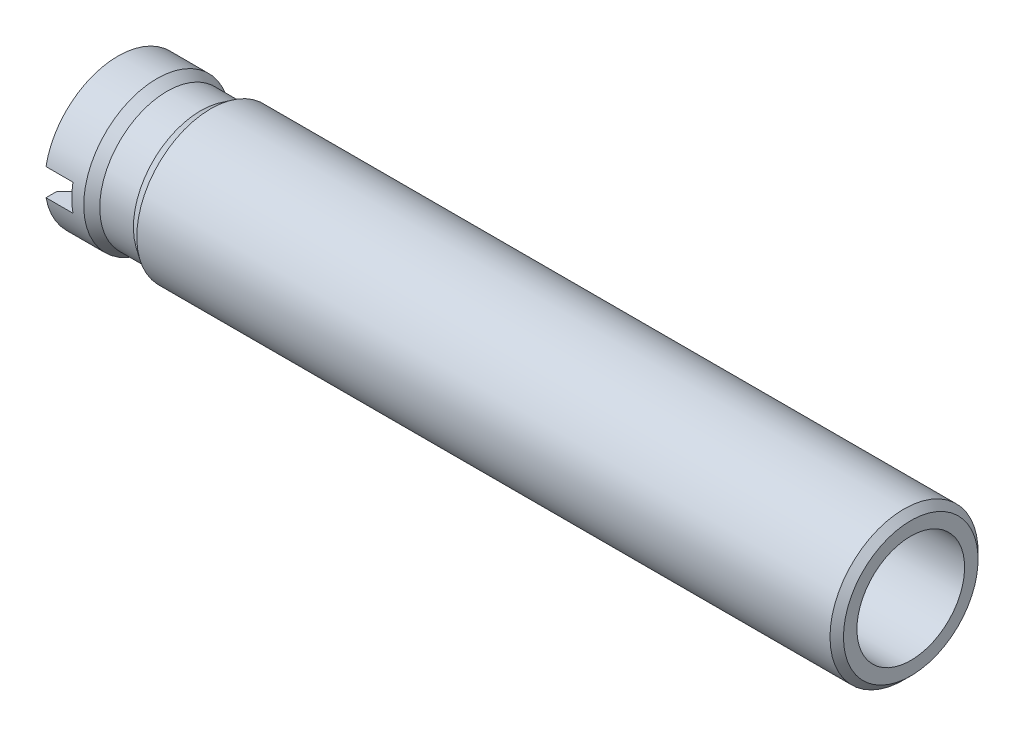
ISO-10303-21;
HEADER;
FILE_DESCRIPTION(('STEP AP214'),'2;1');
FILE_NAME('part.step','',(''),(''),'','','');
FILE_SCHEMA(('AUTOMOTIVE_DESIGN { 1 0 10303 214 1 1 1 1 }'));
ENDSEC;
DATA;
#1=APPLICATION_CONTEXT('core data for automotive mechanical design processes');
#2=APPLICATION_PROTOCOL_DEFINITION('international standard','automotive_design',2000,#1);
#3=PRODUCT_CONTEXT('',#1,'mechanical');
#4=PRODUCT('Part','Part','',(#3));
#5=PRODUCT_RELATED_PRODUCT_CATEGORY('part','',(#4));
#6=PRODUCT_DEFINITION_FORMATION('','',#4);
#7=PRODUCT_DEFINITION_CONTEXT('part definition',#1,'design');
#8=PRODUCT_DEFINITION('design','',#6,#7);
#9=PRODUCT_DEFINITION_SHAPE('','',#8);
#10=(LENGTH_UNIT() NAMED_UNIT(*) SI_UNIT(.MILLI.,.METRE.));
#11=(NAMED_UNIT(*) PLANE_ANGLE_UNIT() SI_UNIT($,.RADIAN.));
#12=(NAMED_UNIT(*) SI_UNIT($,.STERADIAN.) SOLID_ANGLE_UNIT());
#13=UNCERTAINTY_MEASURE_WITH_UNIT(LENGTH_MEASURE(1.E-05),#10,'distance_accuracy_value','');
#14=(GEOMETRIC_REPRESENTATION_CONTEXT(3) GLOBAL_UNCERTAINTY_ASSIGNED_CONTEXT((#13)) GLOBAL_UNIT_ASSIGNED_CONTEXT((#10,
#11,#12)) REPRESENTATION_CONTEXT('',''));
#15=CARTESIAN_POINT('',(0.,0.,0.));
#16=DIRECTION('',(0.,0.,1.));
#17=DIRECTION('',(1.,0.,0.));
#18=AXIS2_PLACEMENT_3D('',#15,#16,#17);
#19=CARTESIAN_POINT('',(-76.4736831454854,1.00000010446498,0.));
#20=DIRECTION('',(-1.,0.,0.));
#21=DIRECTION('',(0.,0.,1.));
#22=AXIS2_PLACEMENT_3D('',#19,#20,#21);
#23=CONICAL_SURFACE('',#22,7.00000000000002,0.531972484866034);
#24=CARTESIAN_POINT('',(-77.9736831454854,1.00000010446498,0.));
#25=DIRECTION('',(-1.,0.,0.));
#26=DIRECTION('',(0.,1.,0.));
#27=AXIS2_PLACEMENT_3D('',#24,#25,#26);
#28=CIRCLE('',#27,7.88285457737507);
#29=CARTESIAN_POINT('',(-77.9736831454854,8.88285468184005,0.));
#30=VERTEX_POINT('',#29);
#31=EDGE_CURVE('E173',#30,#30,#28,.F.);
#32=ORIENTED_EDGE('',*,*,#31,.F.);
#33=EDGE_LOOP('',(#32));
#34=FACE_BOUND('',#33,.T.);
#35=CARTESIAN_POINT('',(-76.4736831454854,1.00000010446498,0.));
#36=DIRECTION('',(-1.,0.,0.));
#37=DIRECTION('',(0.,1.,0.));
#38=AXIS2_PLACEMENT_3D('',#35,#36,#37);
#39=CIRCLE('',#38,7.00000000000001);
#40=CARTESIAN_POINT('',(-76.4736831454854,8.00000010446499,0.));
#41=VERTEX_POINT('',#40);
#42=EDGE_CURVE('E170',#41,#41,#39,.T.);
#43=ORIENTED_EDGE('',*,*,#42,.F.);
#44=EDGE_LOOP('',(#43));
#45=FACE_BOUND('',#44,.T.);
#46=ADVANCED_FACE('F17',(#34,#45),#23,.F.);
#47=CARTESIAN_POINT('',(-85.0514735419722,3.00000010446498,0.));
#48=DIRECTION('',(0.,1.,0.));
#49=DIRECTION('',(0.,0.,1.));
#50=AXIS2_PLACEMENT_3D('',#47,#48,#49);
#51=PLANE('',#50);
#52=DIRECTION('',(0.,0.,1.));
#53=VECTOR('',#52,1.);
#54=CARTESIAN_POINT('',(-83.7631567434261,3.00000010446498,0.));
#55=LINE('',#54,#53);
#56=CARTESIAN_POINT('',(-83.7631567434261,3.00000010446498,9.16722204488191));
#57=VERTEX_POINT('',#56);
#58=CARTESIAN_POINT('',(-83.7631567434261,3.00000010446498,10.6969827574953));
#59=VERTEX_POINT('',#58);
#60=EDGE_CURVE('E103',#57,#59,#55,.T.);
#61=ORIENTED_EDGE('',*,*,#60,.F.);
#62=CARTESIAN_POINT('',(-82.2631567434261,3.00000010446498,7.62491942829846));
#63=CARTESIAN_POINT('',(-82.3878068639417,3.00000010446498,7.75378454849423));
#64=CARTESIAN_POINT('',(-82.5125603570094,3.00000010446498,7.88254960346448));
#65=CARTESIAN_POINT('',(-82.7622493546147,3.00000010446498,8.13990274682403));
#66=CARTESIAN_POINT('',(-82.8871848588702,3.00000010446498,8.26849083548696));
#67=CARTESIAN_POINT('',(-83.1372134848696,3.00000010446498,8.52551356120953));
#68=CARTESIAN_POINT('',(-83.2623066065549,3.00000010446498,8.65394819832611));
#69=CARTESIAN_POINT('',(-83.5126320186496,3.00000010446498,8.91068217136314));
#70=CARTESIAN_POINT('',(-83.6378643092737,3.00000010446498,9.03898150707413));
#71=CARTESIAN_POINT('',(-83.7631567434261,3.00000010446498,9.16722204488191));
#72=B_SPLINE_CURVE_WITH_KNOTS('',3,(#62,#63,#64,#65,#66,#67,#68,#69,#70,#71),.UNSPECIFIED.,.F.,
.F.,(4,2,2,2,4),(0.,0.53786122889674,1.07572162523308,1.61358182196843,2.15144285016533),.UNSPECIFIED.);
#73=CARTESIAN_POINT('',(-82.2631567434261,3.00000010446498,7.62491942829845));
#74=VERTEX_POINT('',#73);
#75=EDGE_CURVE('E109',#74,#57,#72,.T.);
#76=ORIENTED_EDGE('',*,*,#75,.F.);
#77=DIRECTION('',(1.,0.,0.));
#78=VECTOR('',#77,1.);
#79=CARTESIAN_POINT('',(-85.0514735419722,3.00000010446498,7.62491942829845));
#80=LINE('',#79,#78);
#81=CARTESIAN_POINT('',(-79.7631567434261,3.00000010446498,7.62491942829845));
#82=VERTEX_POINT('',#81);
#83=EDGE_CURVE('E97',#82,#74,#80,.F.);
#84=ORIENTED_EDGE('',*,*,#83,.F.);
#85=DIRECTION('',(0.,0.,-1.));
#86=VECTOR('',#85,1.);
#87=CARTESIAN_POINT('',(-79.7631567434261,3.00000010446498,0.));
#88=LINE('',#87,#86);
#89=CARTESIAN_POINT('',(-79.7631567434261,3.00000010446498,10.6969827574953));
#90=VERTEX_POINT('',#89);
#91=EDGE_CURVE('E102',#82,#90,#88,.F.);
#92=ORIENTED_EDGE('',*,*,#91,.T.);
#93=DIRECTION('',(1.,0.,0.));
#94=VECTOR('',#93,1.);
#95=CARTESIAN_POINT('',(-80.8679873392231,3.00000010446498,10.6969827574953));
#96=LINE('',#95,#94);
#97=EDGE_CURVE('E168',#59,#90,#96,.T.);
#98=ORIENTED_EDGE('',*,*,#97,.F.);
#99=EDGE_LOOP('',(#61,#76,#84,#92,#98));
#100=FACE_BOUND('',#99,.T.);
#101=ADVANCED_FACE('F105',(#100),#51,.F.);
#102=CARTESIAN_POINT('',(-79.7631567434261,3.00000010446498,0.));
#103=DIRECTION('',(1.,0.,0.));
#104=DIRECTION('',(0.,0.,-1.));
#105=AXIS2_PLACEMENT_3D('',#102,#103,#104);
#106=PLANE('',#105);
#107=ORIENTED_EDGE('',*,*,#91,.F.);
#108=CARTESIAN_POINT('',(-79.7631567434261,1.00000010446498,0.));
#109=DIRECTION('',(1.,0.,0.));
#110=DIRECTION('',(0.,0.,-1.));
#111=AXIS2_PLACEMENT_3D('',#108,#109,#110);
#112=CIRCLE('',#111,7.88285457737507);
#113=CARTESIAN_POINT('',(-79.7631567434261,-0.999999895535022,7.62491942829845));
#114=VERTEX_POINT('',#113);
#115=EDGE_CURVE('E21',#114,#82,#112,.F.);
#116=ORIENTED_EDGE('',*,*,#115,.F.);
#117=DIRECTION('',(0.,0.,-1.));
#118=VECTOR('',#117,1.);
#119=CARTESIAN_POINT('',(-79.7631567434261,-0.999999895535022,0.));
#120=LINE('',#119,#118);
#121=CARTESIAN_POINT('',(-79.7631567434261,-0.999999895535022,10.6969827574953));
#122=VERTEX_POINT('',#121);
#123=EDGE_CURVE('E121',#114,#122,#120,.F.);
#124=ORIENTED_EDGE('',*,*,#123,.T.);
#125=CARTESIAN_POINT('',(-79.7631567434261,1.00000010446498,0.));
#126=DIRECTION('',(1.,0.,0.));
#127=DIRECTION('',(0.,1.,0.));
#128=AXIS2_PLACEMENT_3D('',#125,#126,#127);
#129=CIRCLE('',#128,10.8823453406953);
#130=EDGE_CURVE('E114',#90,#122,#129,.T.);
#131=ORIENTED_EDGE('',*,*,#130,.F.);
#132=EDGE_LOOP('',(#107,#116,#124,#131));
#133=FACE_BOUND('',#132,.T.);
#134=ADVANCED_FACE('F112',(#133),#106,.F.);
#135=CARTESIAN_POINT('',(-79.7631567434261,-0.999999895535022,0.));
#136=DIRECTION('',(0.,-1.,0.));
#137=DIRECTION('',(0.,0.,-1.));
#138=AXIS2_PLACEMENT_3D('',#135,#136,#137);
#139=PLANE('',#138);
#140=ORIENTED_EDGE('',*,*,#123,.F.);
#141=DIRECTION('',(1.,0.,0.));
#142=VECTOR('',#141,1.);
#143=CARTESIAN_POINT('',(-79.7631567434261,-0.999999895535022,7.62491942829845));
#144=LINE('',#143,#142);
#145=CARTESIAN_POINT('',(-82.2631567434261,-0.999999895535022,7.62491942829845));
#146=VERTEX_POINT('',#145);
#147=EDGE_CURVE('E92',#146,#114,#144,.T.);
#148=ORIENTED_EDGE('',*,*,#147,.F.);
#149=CARTESIAN_POINT('',(-83.7631567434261,-0.999999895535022,9.16722204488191));
#150=CARTESIAN_POINT('',(-83.6378643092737,-0.999999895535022,9.03898150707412));
#151=CARTESIAN_POINT('',(-83.5126320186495,-0.999999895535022,8.91068217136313));
#152=CARTESIAN_POINT('',(-83.2623066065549,-0.999999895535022,8.6539481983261));
#153=CARTESIAN_POINT('',(-83.1372134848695,-0.999999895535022,8.52551356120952));
#154=CARTESIAN_POINT('',(-82.8871848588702,-0.999999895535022,8.26849083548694));
#155=CARTESIAN_POINT('',(-82.7622493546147,-0.999999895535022,8.13990274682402));
#156=CARTESIAN_POINT('',(-82.5125603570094,-0.999999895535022,7.88254960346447));
#157=CARTESIAN_POINT('',(-82.3878068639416,-0.999999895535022,7.75378454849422));
#158=CARTESIAN_POINT('',(-82.2631567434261,-0.999999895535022,7.62491942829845));
#159=B_SPLINE_CURVE_WITH_KNOTS('',3,(#149,#150,#151,#152,#153,#154,#155,#156,#157,#158),
.UNSPECIFIED.,.F.,.F.,(4,2,2,2,4),(0.,0.537861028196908,1.07572122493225,1.61358162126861,
2.15144285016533),.UNSPECIFIED.);
#160=CARTESIAN_POINT('',(-83.7631567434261,-0.999999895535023,9.16722204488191));
#161=VERTEX_POINT('',#160);
#162=EDGE_CURVE('E174',#161,#146,#159,.T.);
#163=ORIENTED_EDGE('',*,*,#162,.F.);
#164=DIRECTION('',(0.,0.,-1.));
#165=VECTOR('',#164,1.);
#166=CARTESIAN_POINT('',(-83.7631567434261,-0.999999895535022,0.));
#167=LINE('',#166,#165);
#168=CARTESIAN_POINT('',(-83.7631567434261,-0.999999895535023,10.6969827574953));
#169=VERTEX_POINT('',#168);
#170=EDGE_CURVE('E116',#169,#161,#167,.T.);
#171=ORIENTED_EDGE('',*,*,#170,.F.);
#172=DIRECTION('',(1.,0.,0.));
#173=VECTOR('',#172,1.);
#174=CARTESIAN_POINT('',(-80.8679873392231,-0.999999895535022,10.6969827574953));
#175=LINE('',#174,#173);
#176=EDGE_CURVE('E177',#122,#169,#175,.F.);
#177=ORIENTED_EDGE('',*,*,#176,.F.);
#178=EDGE_LOOP('',(#140,#148,#163,#171,#177));
#179=FACE_BOUND('',#178,.T.);
#180=ADVANCED_FACE('F238',(#179),#139,.F.);
#181=CARTESIAN_POINT('',(-82.2631567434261,1.00000010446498,0.));
#182=DIRECTION('',(-1.,0.,0.));
#183=DIRECTION('',(0.,0.,1.));
#184=AXIS2_PLACEMENT_3D('',#181,#182,#183);
#185=CONICAL_SURFACE('',#184,7.88285457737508,0.785398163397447);
#186=CARTESIAN_POINT('',(-82.2631567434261,-0.999999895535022,-7.62491942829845));
#187=CARTESIAN_POINT('',(-82.3878068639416,-0.999999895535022,-7.75378454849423));
#188=CARTESIAN_POINT('',(-82.5125603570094,-0.999999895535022,-7.88254960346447));
#189=CARTESIAN_POINT('',(-82.7622493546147,-0.999999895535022,-8.13990274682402));
#190=CARTESIAN_POINT('',(-82.8871848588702,-0.999999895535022,-8.26849083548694));
#191=CARTESIAN_POINT('',(-83.1372134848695,-0.999999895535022,-8.52551356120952));
#192=CARTESIAN_POINT('',(-83.2623066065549,-0.999999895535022,-8.6539481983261));
#193=CARTESIAN_POINT('',(-83.5126320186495,-0.999999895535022,-8.91068217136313));
#194=CARTESIAN_POINT('',(-83.6378643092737,-0.999999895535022,-9.03898150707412));
#195=CARTESIAN_POINT('',(-83.7631567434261,-0.999999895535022,-9.1672220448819));
#196=B_SPLINE_CURVE_WITH_KNOTS('',3,(#186,#187,#188,#189,#190,#191,#192,#193,#194,#195),
.UNSPECIFIED.,.F.,.F.,(4,2,2,2,4),(0.,0.537861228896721,1.07572162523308,1.61358182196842,
2.15144285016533),.UNSPECIFIED.);
#197=CARTESIAN_POINT('',(-82.2631567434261,-0.999999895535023,-7.62491942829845));
#198=VERTEX_POINT('',#197);
#199=CARTESIAN_POINT('',(-83.7631567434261,-0.999999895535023,-9.1672220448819));
#200=VERTEX_POINT('',#199);
#201=EDGE_CURVE('E126',#198,#200,#196,.T.);
#202=ORIENTED_EDGE('',*,*,#201,.T.);
#203=CARTESIAN_POINT('',(-83.7631567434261,1.00000010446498,0.));
#204=DIRECTION('',(-1.,0.,0.));
#205=DIRECTION('',(0.,0.,1.));
#206=AXIS2_PLACEMENT_3D('',#203,#204,#205);
#207=CIRCLE('',#206,9.38285457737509);
#208=EDGE_CURVE('E130',#161,#200,#207,.F.);
#209=ORIENTED_EDGE('',*,*,#208,.F.);
#210=ORIENTED_EDGE('',*,*,#162,.T.);
#211=CARTESIAN_POINT('',(-82.2631567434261,1.00000010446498,0.));
#212=DIRECTION('',(-1.,0.,0.));
#213=DIRECTION('',(0.,1.,0.));
#214=AXIS2_PLACEMENT_3D('',#211,#212,#213);
#215=CIRCLE('',#214,7.88285457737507);
#216=EDGE_CURVE('E171',#198,#146,#215,.T.);
#217=ORIENTED_EDGE('',*,*,#216,.F.);
#218=EDGE_LOOP('',(#202,#209,#210,#217));
#219=FACE_BOUND('',#218,.T.);
#220=ADVANCED_FACE('F241',(#219),#185,.F.);
#221=CARTESIAN_POINT('',(-82.2631567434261,1.00000010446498,0.));
#222=DIRECTION('',(1.,0.,0.));
#223=DIRECTION('',(0.,0.,-1.));
#224=AXIS2_PLACEMENT_3D('',#221,#222,#223);
#225=CYLINDRICAL_SURFACE('',#224,7.88285457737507);
#226=CARTESIAN_POINT('',(-82.2631567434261,1.00000010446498,0.));
#227=DIRECTION('',(-1.,0.,0.));
#228=DIRECTION('',(0.,1.,0.));
#229=AXIS2_PLACEMENT_3D('',#226,#227,#228);
#230=CIRCLE('',#229,7.88285457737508);
#231=CARTESIAN_POINT('',(-82.2631567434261,3.00000010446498,-7.62491942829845));
#232=VERTEX_POINT('',#231);
#233=EDGE_CURVE('E183',#232,#74,#230,.F.);
#234=ORIENTED_EDGE('',*,*,#233,.F.);
#235=DIRECTION('',(1.,0.,0.));
#236=VECTOR('',#235,1.);
#237=CARTESIAN_POINT('',(-85.0514735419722,3.00000010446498,-7.62491942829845));
#238=LINE('',#237,#236);
#239=CARTESIAN_POINT('',(-79.7631567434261,3.00000010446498,-7.62491942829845));
#240=VERTEX_POINT('',#239);
#241=EDGE_CURVE('E134',#232,#240,#238,.T.);
#242=ORIENTED_EDGE('',*,*,#241,.T.);
#243=CARTESIAN_POINT('',(-79.7631567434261,1.00000010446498,0.));
#244=DIRECTION('',(1.,0.,0.));
#245=DIRECTION('',(0.,0.,-1.));
#246=AXIS2_PLACEMENT_3D('',#243,#244,#245);
#247=CIRCLE('',#246,7.88285457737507);
#248=CARTESIAN_POINT('',(-79.7631567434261,-0.999999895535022,-7.62491942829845));
#249=VERTEX_POINT('',#248);
#250=EDGE_CURVE('E125',#240,#249,#247,.F.);
#251=ORIENTED_EDGE('',*,*,#250,.T.);
#252=DIRECTION('',(1.,0.,0.));
#253=VECTOR('',#252,1.);
#254=CARTESIAN_POINT('',(-79.7631567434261,-0.999999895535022,-7.62491942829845));
#255=LINE('',#254,#253);
#256=EDGE_CURVE('E127',#249,#198,#255,.F.);
#257=ORIENTED_EDGE('',*,*,#256,.T.);
#258=ORIENTED_EDGE('',*,*,#216,.T.);
#259=ORIENTED_EDGE('',*,*,#147,.T.);
#260=ORIENTED_EDGE('',*,*,#115,.T.);
#261=ORIENTED_EDGE('',*,*,#83,.T.);
#262=EDGE_LOOP('',(#234,#242,#251,#257,#258,#259,#260,#261));
#263=FACE_BOUND('',#262,.T.);
#264=ORIENTED_EDGE('',*,*,#31,.T.);
#265=EDGE_LOOP('',(#264));
#266=FACE_BOUND('',#265,.T.);
#267=ADVANCED_FACE('F95',(#263,#266),#225,.F.);
#268=CARTESIAN_POINT('',(-82.2631567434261,1.00000010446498,0.));
#269=DIRECTION('',(-1.,0.,0.));
#270=DIRECTION('',(0.,0.,1.));
#271=AXIS2_PLACEMENT_3D('',#268,#269,#270);
#272=CONICAL_SURFACE('',#271,7.88285457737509,0.785398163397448);
#273=CARTESIAN_POINT('',(-83.7631567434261,3.00000010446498,-9.16722204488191));
#274=CARTESIAN_POINT('',(-83.6378643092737,3.00000010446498,-9.03898150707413));
#275=CARTESIAN_POINT('',(-83.5126320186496,3.00000010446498,-8.91068217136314));
#276=CARTESIAN_POINT('',(-83.2623066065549,3.00000010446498,-8.65394819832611));
#277=CARTESIAN_POINT('',(-83.1372134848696,3.00000010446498,-8.52551356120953));
#278=CARTESIAN_POINT('',(-82.8871848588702,3.00000010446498,-8.26849083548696));
#279=CARTESIAN_POINT('',(-82.7622493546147,3.00000010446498,-8.13990274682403));
#280=CARTESIAN_POINT('',(-82.5125603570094,3.00000010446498,-7.88254960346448));
#281=CARTESIAN_POINT('',(-82.3878068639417,3.00000010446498,-7.75378454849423));
#282=CARTESIAN_POINT('',(-82.2631567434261,3.00000010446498,-7.62491942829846));
#283=B_SPLINE_CURVE_WITH_KNOTS('',3,(#273,#274,#275,#276,#277,#278,#279,#280,#281,#282),
.UNSPECIFIED.,.F.,.F.,(4,2,2,2,4),(0.,0.537861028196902,1.07572122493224,1.61358162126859,
2.15144285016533),.UNSPECIFIED.);
#284=CARTESIAN_POINT('',(-83.7631567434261,3.00000010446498,-9.16722204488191));
#285=VERTEX_POINT('',#284);
#286=EDGE_CURVE('E133',#285,#232,#283,.T.);
#287=ORIENTED_EDGE('',*,*,#286,.T.);
#288=ORIENTED_EDGE('',*,*,#233,.T.);
#289=ORIENTED_EDGE('',*,*,#75,.T.);
#290=CARTESIAN_POINT('',(-83.7631567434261,1.00000010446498,0.));
#291=DIRECTION('',(-1.,0.,0.));
#292=DIRECTION('',(0.,0.,1.));
#293=AXIS2_PLACEMENT_3D('',#290,#291,#292);
#294=CIRCLE('',#293,9.3828545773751);
#295=EDGE_CURVE('E138',#285,#57,#294,.F.);
#296=ORIENTED_EDGE('',*,*,#295,.F.);
#297=EDGE_LOOP('',(#287,#288,#289,#296));
#298=FACE_BOUND('',#297,.T.);
#299=ADVANCED_FACE('F212',(#298),#272,.F.);
#300=CARTESIAN_POINT('',(-76.4736831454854,1.00000010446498,0.));
#301=DIRECTION('',(1.,0.,0.));
#302=DIRECTION('',(0.,0.,-1.));
#303=AXIS2_PLACEMENT_3D('',#300,#301,#302);
#304=CYLINDRICAL_SURFACE('',#303,7.00000000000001);
#305=ORIENTED_EDGE('',*,*,#42,.T.);
#306=EDGE_LOOP('',(#305));
#307=FACE_BOUND('',#306,.T.);
#308=CARTESIAN_POINT('',(-71.4736831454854,1.00000010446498,0.));
#309=DIRECTION('',(1.,0.,0.));
#310=DIRECTION('',(0.,1.,0.));
#311=AXIS2_PLACEMENT_3D('',#308,#309,#310);
#312=CIRCLE('',#311,7.00000000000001);
#313=CARTESIAN_POINT('',(-71.4736831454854,8.00000010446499,0.));
#314=VERTEX_POINT('',#313);
#315=EDGE_CURVE('E165',#314,#314,#312,.F.);
#316=ORIENTED_EDGE('',*,*,#315,.F.);
#317=EDGE_LOOP('',(#316));
#318=FACE_BOUND('',#317,.T.);
#319=ADVANCED_FACE('F217',(#307,#318),#304,.F.);
#320=CARTESIAN_POINT('',(-83.7631567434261,11.1326000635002,0.));
#321=DIRECTION('',(-1.,0.,0.));
#322=DIRECTION('',(0.,-1.,0.));
#323=AXIS2_PLACEMENT_3D('',#320,#321,#322);
#324=PLANE('',#323);
#325=CARTESIAN_POINT('',(-83.7631567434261,1.00000010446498,0.));
#326=DIRECTION('',(1.,0.,0.));
#327=DIRECTION('',(0.,1.,0.));
#328=AXIS2_PLACEMENT_3D('',#325,#326,#327);
#329=CIRCLE('',#328,10.8823453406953);
#330=CARTESIAN_POINT('',(-83.7631567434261,-0.999999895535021,-10.6969827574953));
#331=VERTEX_POINT('',#330);
#332=EDGE_CURVE('E162',#169,#331,#329,.T.);
#333=ORIENTED_EDGE('',*,*,#332,.F.);
#334=ORIENTED_EDGE('',*,*,#170,.T.);
#335=ORIENTED_EDGE('',*,*,#208,.T.);
#336=DIRECTION('',(0.,0.,-1.));
#337=VECTOR('',#336,1.);
#338=CARTESIAN_POINT('',(-83.7631567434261,-0.999999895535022,0.));
#339=LINE('',#338,#337);
#340=EDGE_CURVE('E123',#200,#331,#339,.T.);
#341=ORIENTED_EDGE('',*,*,#340,.T.);
#342=EDGE_LOOP('',(#333,#334,#335,#341));
#343=FACE_BOUND('',#342,.T.);
#344=ADVANCED_FACE('F255',(#343),#324,.T.);
#345=CARTESIAN_POINT('',(-79.7631567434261,-0.999999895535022,0.));
#346=DIRECTION('',(0.,-1.,0.));
#347=DIRECTION('',(0.,0.,-1.));
#348=AXIS2_PLACEMENT_3D('',#345,#346,#347);
#349=PLANE('',#348);
#350=ORIENTED_EDGE('',*,*,#340,.F.);
#351=ORIENTED_EDGE('',*,*,#201,.F.);
#352=ORIENTED_EDGE('',*,*,#256,.F.);
#353=DIRECTION('',(0.,0.,-1.));
#354=VECTOR('',#353,1.);
#355=CARTESIAN_POINT('',(-79.7631567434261,-0.999999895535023,0.));
#356=LINE('',#355,#354);
#357=CARTESIAN_POINT('',(-79.7631567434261,-0.999999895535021,-10.6969827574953));
#358=VERTEX_POINT('',#357);
#359=EDGE_CURVE('E131',#249,#358,#356,.T.);
#360=ORIENTED_EDGE('',*,*,#359,.T.);
#361=DIRECTION('',(1.,0.,0.));
#362=VECTOR('',#361,1.);
#363=CARTESIAN_POINT('',(-80.8679873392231,-0.99999989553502,-10.6969827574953));
#364=LINE('',#363,#362);
#365=EDGE_CURVE('E159',#331,#358,#364,.T.);
#366=ORIENTED_EDGE('',*,*,#365,.F.);
#367=EDGE_LOOP('',(#350,#351,#352,#360,#366));
#368=FACE_BOUND('',#367,.T.);
#369=ADVANCED_FACE('F251',(#368),#349,.F.);
#370=CARTESIAN_POINT('',(-79.7631567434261,3.00000010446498,0.));
#371=DIRECTION('',(1.,0.,0.));
#372=DIRECTION('',(0.,0.,-1.));
#373=AXIS2_PLACEMENT_3D('',#370,#371,#372);
#374=PLANE('',#373);
#375=ORIENTED_EDGE('',*,*,#359,.F.);
#376=ORIENTED_EDGE('',*,*,#250,.F.);
#377=DIRECTION('',(0.,0.,1.));
#378=VECTOR('',#377,1.);
#379=CARTESIAN_POINT('',(-79.7631567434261,3.00000010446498,0.));
#380=LINE('',#379,#378);
#381=CARTESIAN_POINT('',(-79.7631567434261,3.00000010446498,-10.6969827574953));
#382=VERTEX_POINT('',#381);
#383=EDGE_CURVE('E136',#240,#382,#380,.F.);
#384=ORIENTED_EDGE('',*,*,#383,.T.);
#385=CARTESIAN_POINT('',(-79.7631567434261,1.00000010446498,0.));
#386=DIRECTION('',(1.,0.,0.));
#387=DIRECTION('',(0.,1.,0.));
#388=AXIS2_PLACEMENT_3D('',#385,#386,#387);
#389=CIRCLE('',#388,10.8823453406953);
#390=EDGE_CURVE('E157',#358,#382,#389,.T.);
#391=ORIENTED_EDGE('',*,*,#390,.F.);
#392=EDGE_LOOP('',(#375,#376,#384,#391));
#393=FACE_BOUND('',#392,.T.);
#394=ADVANCED_FACE('F254',(#393),#374,.F.);
#395=CARTESIAN_POINT('',(-85.0514735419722,3.00000010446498,0.));
#396=DIRECTION('',(0.,1.,0.));
#397=DIRECTION('',(0.,0.,1.));
#398=AXIS2_PLACEMENT_3D('',#395,#396,#397);
#399=PLANE('',#398);
#400=ORIENTED_EDGE('',*,*,#383,.F.);
#401=ORIENTED_EDGE('',*,*,#241,.F.);
#402=ORIENTED_EDGE('',*,*,#286,.F.);
#403=DIRECTION('',(0.,0.,1.));
#404=VECTOR('',#403,1.);
#405=CARTESIAN_POINT('',(-83.7631567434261,3.00000010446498,0.));
#406=LINE('',#405,#404);
#407=CARTESIAN_POINT('',(-83.7631567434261,3.00000010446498,-10.6969827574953));
#408=VERTEX_POINT('',#407);
#409=EDGE_CURVE('E36',#408,#285,#406,.T.);
#410=ORIENTED_EDGE('',*,*,#409,.F.);
#411=DIRECTION('',(1.,0.,0.));
#412=VECTOR('',#411,1.);
#413=CARTESIAN_POINT('',(-80.8679873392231,3.00000010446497,-10.6969827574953));
#414=LINE('',#413,#412);
#415=EDGE_CURVE('E154',#382,#408,#414,.F.);
#416=ORIENTED_EDGE('',*,*,#415,.F.);
#417=EDGE_LOOP('',(#400,#401,#402,#410,#416));
#418=FACE_BOUND('',#417,.T.);
#419=ADVANCED_FACE('F208',(#418),#399,.F.);
#420=CARTESIAN_POINT('',(-83.7631567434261,11.1326000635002,0.));
#421=DIRECTION('',(-1.,0.,0.));
#422=DIRECTION('',(0.,-1.,0.));
#423=AXIS2_PLACEMENT_3D('',#420,#421,#422);
#424=PLANE('',#423);
#425=ORIENTED_EDGE('',*,*,#409,.T.);
#426=ORIENTED_EDGE('',*,*,#295,.T.);
#427=ORIENTED_EDGE('',*,*,#60,.T.);
#428=CARTESIAN_POINT('',(-83.7631567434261,1.00000010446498,0.));
#429=DIRECTION('',(1.,0.,0.));
#430=DIRECTION('',(0.,1.,0.));
#431=AXIS2_PLACEMENT_3D('',#428,#429,#430);
#432=CIRCLE('',#431,10.8823453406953);
#433=EDGE_CURVE('E153',#408,#59,#432,.T.);
#434=ORIENTED_EDGE('',*,*,#433,.F.);
#435=EDGE_LOOP('',(#425,#426,#427,#434));
#436=FACE_BOUND('',#435,.T.);
#437=ADVANCED_FACE('F263',(#436),#424,.T.);
#438=CARTESIAN_POINT('',(-71.4736831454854,1.00000010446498,0.));
#439=DIRECTION('',(1.,0.,0.));
#440=DIRECTION('',(0.,0.,-1.));
#441=AXIS2_PLACEMENT_3D('',#438,#439,#440);
#442=CONICAL_SURFACE('',#441,7.00000000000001,0.588002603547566);
#443=ORIENTED_EDGE('',*,*,#315,.T.);
#444=EDGE_LOOP('',(#443));
#445=FACE_BOUND('',#444,.T.);
#446=CARTESIAN_POINT('',(-69.9736831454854,1.00000010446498,0.));
#447=DIRECTION('',(-1.,0.,0.));
#448=DIRECTION('',(0.,1.,0.));
#449=AXIS2_PLACEMENT_3D('',#446,#447,#448);
#450=CIRCLE('',#449,8.00000000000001);
#451=CARTESIAN_POINT('',(-69.9736831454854,9.00000010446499,0.));
#452=VERTEX_POINT('',#451);
#453=EDGE_CURVE('E149',#452,#452,#450,.T.);
#454=ORIENTED_EDGE('',*,*,#453,.F.);
#455=EDGE_LOOP('',(#454));
#456=FACE_BOUND('',#455,.T.);
#457=ADVANCED_FACE('F296',(#445,#456),#442,.F.);
#458=CARTESIAN_POINT('',(-80.8679873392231,1.00000010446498,0.));
#459=DIRECTION('',(1.,0.,0.));
#460=DIRECTION('',(0.,1.,0.));
#461=AXIS2_PLACEMENT_3D('',#458,#459,#460);
#462=CYLINDRICAL_SURFACE('',#461,10.8823453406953);
#463=CARTESIAN_POINT('',(-77.9728179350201,1.00000010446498,0.));
#464=DIRECTION('',(-1.,0.,0.));
#465=DIRECTION('',(0.,1.,0.));
#466=AXIS2_PLACEMENT_3D('',#463,#464,#465);
#467=CIRCLE('',#466,10.8823453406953);
#468=CARTESIAN_POINT('',(-77.9728179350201,11.8823454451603,0.));
#469=VERTEX_POINT('',#468);
#470=EDGE_CURVE('E152',#469,#469,#467,.F.);
#471=ORIENTED_EDGE('',*,*,#470,.F.);
#472=EDGE_LOOP('',(#471));
#473=FACE_BOUND('',#472,.T.);
#474=ORIENTED_EDGE('',*,*,#415,.T.);
#475=ORIENTED_EDGE('',*,*,#433,.T.);
#476=ORIENTED_EDGE('',*,*,#97,.T.);
#477=ORIENTED_EDGE('',*,*,#130,.T.);
#478=ORIENTED_EDGE('',*,*,#176,.T.);
#479=ORIENTED_EDGE('',*,*,#332,.T.);
#480=ORIENTED_EDGE('',*,*,#365,.T.);
#481=ORIENTED_EDGE('',*,*,#390,.T.);
#482=EDGE_LOOP('',(#474,#475,#476,#477,#478,#479,#480,#481));
#483=FACE_BOUND('',#482,.T.);
#484=ADVANCED_FACE('F293',(#473,#483),#462,.T.);
#485=CARTESIAN_POINT('',(-69.9736831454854,1.00000010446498,0.));
#486=DIRECTION('',(1.,0.,0.));
#487=DIRECTION('',(0.,1.,0.));
#488=AXIS2_PLACEMENT_3D('',#485,#486,#487);
#489=CYLINDRICAL_SURFACE('',#488,8.00000000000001);
#490=ORIENTED_EDGE('',*,*,#453,.T.);
#491=EDGE_LOOP('',(#490));
#492=FACE_BOUND('',#491,.T.);
#493=CARTESIAN_POINT('',(34.0263168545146,1.00000010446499,0.));
#494=DIRECTION('',(1.,0.,0.));
#495=DIRECTION('',(0.,1.,0.));
#496=AXIS2_PLACEMENT_3D('',#493,#494,#495);
#497=CIRCLE('',#496,8.00000000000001);
#498=CARTESIAN_POINT('',(34.0263168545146,9.000000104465,0.));
#499=VERTEX_POINT('',#498);
#500=EDGE_CURVE('E143',#499,#499,#497,.F.);
#501=ORIENTED_EDGE('',*,*,#500,.F.);
#502=EDGE_LOOP('',(#501));
#503=FACE_BOUND('',#502,.T.);
#504=ADVANCED_FACE('F289',(#492,#503),#489,.F.);
#505=CARTESIAN_POINT('',(-77.9728179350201,1.00000010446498,0.));
#506=DIRECTION('',(-1.,0.,0.));
#507=DIRECTION('',(0.,0.,1.));
#508=AXIS2_PLACEMENT_3D('',#505,#506,#507);
#509=CONICAL_SURFACE('',#508,10.8823453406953,0.531972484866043);
#510=CARTESIAN_POINT('',(-76.4736831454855,1.00000010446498,0.));
#511=DIRECTION('',(1.,0.,0.));
#512=DIRECTION('',(0.,1.,0.));
#513=AXIS2_PLACEMENT_3D('',#510,#511,#512);
#514=CIRCLE('',#513,10.);
#515=CARTESIAN_POINT('',(-76.4736831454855,11.000000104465,0.));
#516=VERTEX_POINT('',#515);
#517=EDGE_CURVE('E139',#516,#516,#514,.T.);
#518=ORIENTED_EDGE('',*,*,#517,.F.);
#519=EDGE_LOOP('',(#518));
#520=FACE_BOUND('',#519,.T.);
#521=ORIENTED_EDGE('',*,*,#470,.T.);
#522=EDGE_LOOP('',(#521));
#523=FACE_BOUND('',#522,.T.);
#524=ADVANCED_FACE('F286',(#520,#523),#509,.T.);
#525=CARTESIAN_POINT('',(34.0263168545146,10.000000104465,0.));
#526=DIRECTION('',(1.,0.,0.));
#527=DIRECTION('',(0.,0.,-1.));
#528=AXIS2_PLACEMENT_3D('',#525,#526,#527);
#529=PLANE('',#528);
#530=CARTESIAN_POINT('',(34.0263168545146,1.00000010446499,0.));
#531=DIRECTION('',(-1.,0.,0.));
#532=DIRECTION('',(0.,0.,1.));
#533=AXIS2_PLACEMENT_3D('',#530,#531,#532);
#534=CIRCLE('',#533,10.);
#535=CARTESIAN_POINT('',(34.0263168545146,1.00000010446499,10.));
#536=VERTEX_POINT('',#535);
#537=EDGE_CURVE('E142',#536,#536,#534,.T.);
#538=ORIENTED_EDGE('',*,*,#537,.F.);
#539=EDGE_LOOP('',(#538));
#540=FACE_BOUND('',#539,.T.);
#541=ORIENTED_EDGE('',*,*,#500,.T.);
#542=EDGE_LOOP('',(#541));
#543=FACE_BOUND('',#542,.T.);
#544=ADVANCED_FACE('F282',(#540,#543),#529,.T.);
#545=CARTESIAN_POINT('',(-73.9736831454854,1.00000010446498,0.));
#546=DIRECTION('',(1.,0.,0.));
#547=DIRECTION('',(0.,1.,0.));
#548=AXIS2_PLACEMENT_3D('',#545,#546,#547);
#549=CYLINDRICAL_SURFACE('',#548,10.);
#550=CARTESIAN_POINT('',(-71.4736831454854,1.00000010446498,0.));
#551=DIRECTION('',(1.,0.,0.));
#552=DIRECTION('',(0.,1.,0.));
#553=AXIS2_PLACEMENT_3D('',#550,#551,#552);
#554=CIRCLE('',#553,10.);
#555=CARTESIAN_POINT('',(-71.4736831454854,11.000000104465,0.));
#556=VERTEX_POINT('',#555);
#557=EDGE_CURVE('E144',#556,#556,#554,.T.);
#558=ORIENTED_EDGE('',*,*,#557,.F.);
#559=EDGE_LOOP('',(#558));
#560=FACE_BOUND('',#559,.T.);
#561=ORIENTED_EDGE('',*,*,#517,.T.);
#562=EDGE_LOOP('',(#561));
#563=FACE_BOUND('',#562,.T.);
#564=ADVANCED_FACE('F279',(#560,#563),#549,.T.);
#565=CARTESIAN_POINT('',(33.0263168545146,1.00000010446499,0.));
#566=DIRECTION('',(-1.,0.,0.));
#567=DIRECTION('',(0.,0.,1.));
#568=AXIS2_PLACEMENT_3D('',#565,#566,#567);
#569=CONICAL_SURFACE('',#568,11.,0.785398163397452);
#570=ORIENTED_EDGE('',*,*,#537,.T.);
#571=EDGE_LOOP('',(#570));
#572=FACE_BOUND('',#571,.T.);
#573=CARTESIAN_POINT('',(33.0263168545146,1.00000010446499,0.));
#574=DIRECTION('',(1.,0.,0.));
#575=DIRECTION('',(0.,1.,0.));
#576=AXIS2_PLACEMENT_3D('',#573,#574,#575);
#577=CIRCLE('',#576,11.);
#578=CARTESIAN_POINT('',(33.0263168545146,12.000000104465,0.));
#579=VERTEX_POINT('',#578);
#580=EDGE_CURVE('E27',#579,#579,#577,.F.);
#581=ORIENTED_EDGE('',*,*,#580,.F.);
#582=EDGE_LOOP('',(#581));
#583=FACE_BOUND('',#582,.T.);
#584=ADVANCED_FACE('F271',(#572,#583),#569,.T.);
#585=CARTESIAN_POINT('',(-69.9736831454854,1.00000010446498,0.));
#586=DIRECTION('',(1.,0.,0.));
#587=DIRECTION('',(0.,0.,-1.));
#588=AXIS2_PLACEMENT_3D('',#585,#586,#587);
#589=CONICAL_SURFACE('',#588,11.,0.588002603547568);
#590=CARTESIAN_POINT('',(-69.9736831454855,1.00000010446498,0.));
#591=DIRECTION('',(1.,0.,0.));
#592=DIRECTION('',(0.,1.,0.));
#593=AXIS2_PLACEMENT_3D('',#590,#591,#592);
#594=CIRCLE('',#593,11.);
#595=CARTESIAN_POINT('',(-69.9736831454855,12.000000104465,0.));
#596=VERTEX_POINT('',#595);
#597=EDGE_CURVE('E11',#596,#596,#594,.T.);
#598=ORIENTED_EDGE('',*,*,#597,.F.);
#599=EDGE_LOOP('',(#598));
#600=FACE_BOUND('',#599,.T.);
#601=ORIENTED_EDGE('',*,*,#557,.T.);
#602=EDGE_LOOP('',(#601));
#603=FACE_BOUND('',#602,.T.);
#604=ADVANCED_FACE('F266',(#600,#603),#589,.T.);
#605=CARTESIAN_POINT('',(-18.4736831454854,1.00000010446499,0.));
#606=DIRECTION('',(1.,0.,0.));
#607=DIRECTION('',(0.,1.,0.));
#608=AXIS2_PLACEMENT_3D('',#605,#606,#607);
#609=CYLINDRICAL_SURFACE('',#608,11.);
#610=ORIENTED_EDGE('',*,*,#580,.T.);
#611=EDGE_LOOP('',(#610));
#612=FACE_BOUND('',#611,.T.);
#613=ORIENTED_EDGE('',*,*,#597,.T.);
#614=EDGE_LOOP('',(#613));
#615=FACE_BOUND('',#614,.T.);
#616=ADVANCED_FACE('F19',(#612,#615),#609,.T.);
#617=CLOSED_SHELL('',(#46,#101,#134,#180,#220,#267,#299,#319,#344,#369,#394,#419,#437,#457,#484,
#504,#524,#544,#564,#584,#604,#616));
#618=MANIFOLD_SOLID_BREP('B1',#617);
#619=ADVANCED_BREP_SHAPE_REPRESENTATION('',(#18,#618),#14);
#620=SHAPE_DEFINITION_REPRESENTATION(#9,#619);
ENDSEC;
END-ISO-10303-21;
